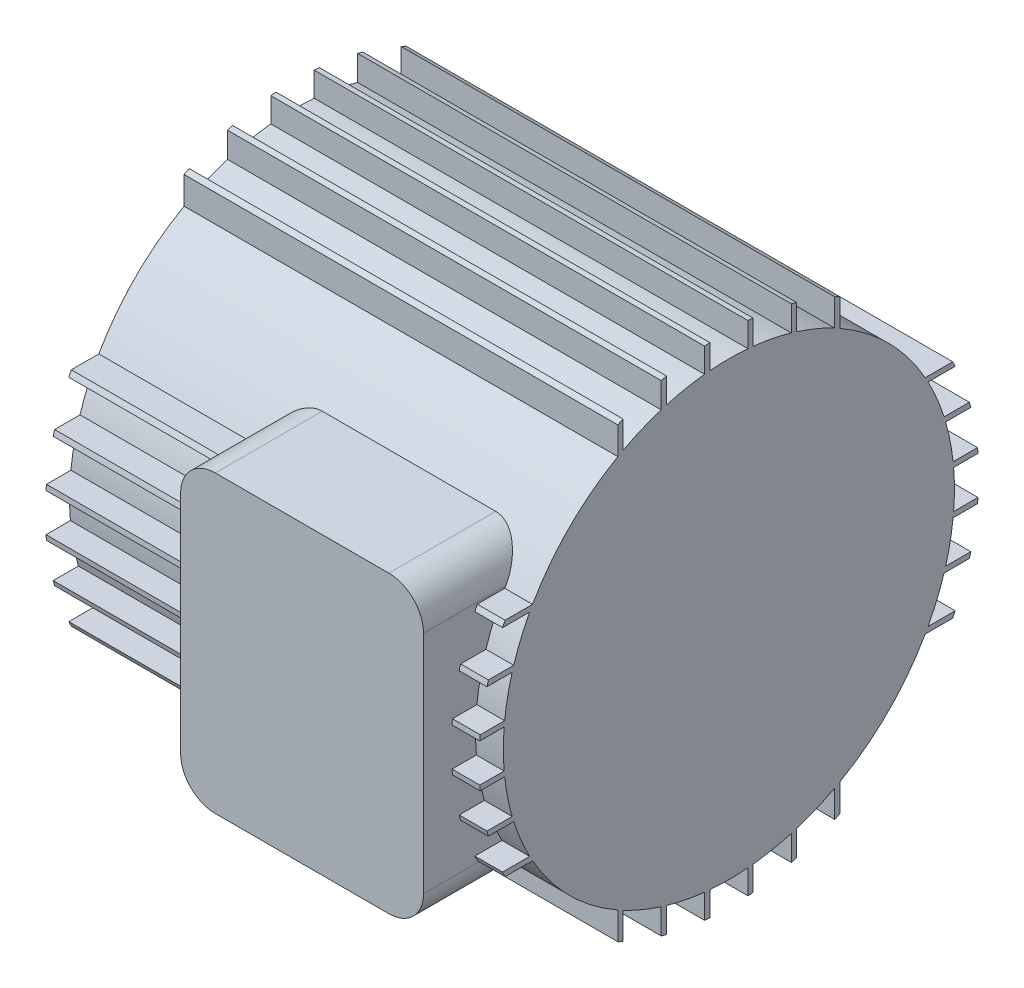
from build123d import *

# Parameters (mm, degrees)
ESQUISSE3_R                  = 65
BASE_EXTRUSION_DEPTH         = 125
BOSS_EXTRU_4_DEPTH           = 125
R_P_TITION_CIRCULAIRE1_COUNT = 4
ESQUISSE5_W                  = 70
ESQUISSE5_H                  = 85
BOITE_DE_RACCORDEMENT_DEPTH  = 80
CONG_1_R                     = 10


with BuildPart() as part:
    # Esquisse3 → Base-Extrusion (new body)
    with BuildSketch(Plane(origin=(0, 0, 0), x_dir=(0, 0, -1), z_dir=(1, 0, 0))):
        Circle(ESQUISSE3_R)
    extrude(amount=-BASE_EXTRUSION_DEPTH)

    # Esquisse4 → Boss.-Extru.4 (add)
    with BuildSketch(Plane(origin=(0, 0, 0), x_dir=(0, 0, -1), z_dir=(1, 0, 0))):
        with BuildLine():
            Line((62.457985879, 18), (69.713700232, 18))
            ThreePointArc((69.713700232, 18), (69.515441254, 18.751091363), (69.309090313, 19.5))
            Line((69.309090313, 19.5), (62.006048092, 19.5))
            ThreePointArc((62.006048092, 19.5), (62.236536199, 18.751361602), (62.457985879, 18))
        make_face()
        with BuildLine():
            Line((56.577380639, -32), (64.498061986, -32))
            ThreePointArc((64.498061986, -32), (64.863756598, -31.252089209), (65.220778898, -30.5))
            Line((65.220778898, -30.5), (57.399912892, -30.5))
            ThreePointArc((57.399912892, -30.5), (56.993581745, -31.25270612), (56.577380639, -32))
        make_face()
        with BuildLine():
            Line((62.006048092, -19.5), (69.309090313, -19.5))
            ThreePointArc((69.309090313, -19.5), (69.515441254, -18.751091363), (69.713700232, -18))
            Line((69.713700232, -18), (62.457985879, -18))
            ThreePointArc((62.457985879, -18), (62.236536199, -18.751361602), (62.006048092, -19.5))
        make_face()
        with BuildLine():
            Line((64.621977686, -7), (71.658914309, -7))
            ThreePointArc((71.658914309, -7), (71.728189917, -6.250341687), (71.789623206, -5.5))
            Line((71.789623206, -5.5), (64.766889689, -5.5))
            ThreePointArc((64.766889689, -5.5), (64.698780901, -6.250419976), (64.621977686, -7))
        make_face()
        with BuildLine():
            Line((64.766889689, 5.5), (71.789623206, 5.5))
            ThreePointArc((71.789623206, 5.5), (71.728189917, 6.250341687), (71.658914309, 7))
            Line((71.658914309, 7), (64.621977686, 7))
            ThreePointArc((64.621977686, 7), (64.698780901, 6.250419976), (64.766889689, 5.5))
        make_face()
        with BuildLine():
            Line((57.399912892, 30.5), (65.220778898, 30.5))
            ThreePointArc((65.220778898, 30.5), (64.863756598, 31.252089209), (64.498061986, 32))
            Line((64.498061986, 32), (56.577380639, 32))
            ThreePointArc((56.577380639, 32), (56.993581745, 31.25270612), (57.399912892, 30.5))
        make_face()
    boss_extru_4 = extrude(amount=-BOSS_EXTRU_4_DEPTH)

    # R_p_tition circulaire1: Boss.-Extru.4 ×4 about axis
    r_p_tition_circulaire1_axis = Axis((0, 0, 0), (1, 0, 0))
    for i in range(1, R_P_TITION_CIRCULAIRE1_COUNT):
        add(boss_extru_4.rotate(r_p_tition_circulaire1_axis, i * 360 / R_P_TITION_CIRCULAIRE1_COUNT))

    # Esquisse5 → boite de raccordement (add)
    with BuildSketch(Plane.XY):
        with Locations((-43, 0)):
            Rectangle(ESQUISSE5_W, ESQUISSE5_H)
    extrude(amount=BOITE_DE_RACCORDEMENT_DEPTH)

    # Cong_1
    cong_1_edges = [part.edges().sort_by_distance(p)[0] for p in [
        (-8, -42.5, 64.590394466),
        (-8, 42.5, 64.590394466),
        (-78, 42.5, 64.590394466),
        (-78, -42.5, 64.590394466),
    ]]
    fillet(cong_1_edges, radius=CONG_1_R)


solid = part.part
